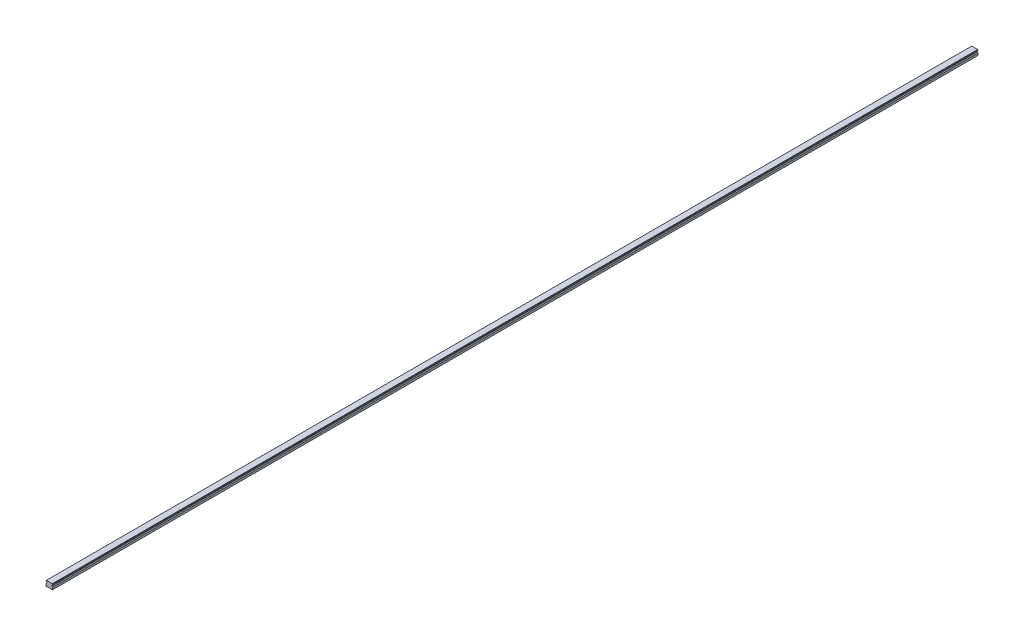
from build123d import *

# Parameters (mm, degrees)
SKETCH1_W           = 20
SKETCH1_H           = 16.3
BOSS_EXTRUDE1_DEPTH = 1400
CUT_EXTRUDE1_DEPTH  = 2801.065301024
CHAMFER1_SIZE       = 1
FILLET1_R           = 1
CUT_EXTRUDE2_DEPTH  = 2801.065301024
SKETCH5_R           = 3
SKETCH5_R_2         = 2.5
CUT_EXTRUDE5_DEPTH  = 10
SKETCH5_2_R         = 2.5
CUT_EXTRUDE6_DEPTH  = 13
LPATTERN2_COUNT     = 47
LPATTERN2_PITCH     = 60


with BuildPart() as part:
    # Sketch1 → Boss-Extrude1 (new, symmetric)
    with BuildSketch(Plane.XY):
        with Locations((0, 8.15)):
            Rectangle(SKETCH1_W, SKETCH1_H)
    extrude(amount=BOSS_EXTRUDE1_DEPTH, both=True)

    # Sketch2 → Cut-Extrude1 (cut, through all)
    with BuildSketch(Plane.XY.offset(1400)):
        Polygon((-10, 14.3), (-10, 7.3), (-7.666666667, 9.633333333), (-7.666666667, 11.966666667), align=None)
        Polygon((7.666666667, 11.966666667), (10, 14.3), (10, 7.3), (7.666666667, 9.633333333), align=None)
    extrude(amount=-CUT_EXTRUDE1_DEPTH, mode=Mode.SUBTRACT)

    # Chamfer1
    chamfer1_edges = [part.edges().sort_by_distance(p)[0] for p in [
        (-10, 16.3, 0),
        (10, 16.3, 0),
        (10, 0, 0),
        (-10, 0, 0),
    ]]
    chamfer(chamfer1_edges, length=CHAMFER1_SIZE)

    # Fillet1
    fillet1_edges = [part.edges().sort_by_distance(p)[0] for p in [
        (-7.666666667, 11.966666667, 0),
        (-7.666666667, 9.633333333, 0),
        (7.666666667, 9.633333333, 0),
        (7.666666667, 11.966666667, 0),
    ]]
    fillet(fillet1_edges, radius=FILLET1_R)

    # Sketch3 → Cut-Extrude2 (cut, through all)
    with BuildSketch(Plane.XY.offset(1400)):
        Polygon((-6, 0), (-5, 1), (5, 1), (6, 0), align=None)
    extrude(amount=-CUT_EXTRUDE2_DEPTH, mode=Mode.SUBTRACT)

    # Sketch5 → Cut-Extrude5 (cut)
    with BuildSketch(Plane.XZ.offset(-1)):
        with Locations(Location((0, 1380, 0), (0, 0, 270))):
            Circle(SKETCH5_R)
        with Locations(Location((0, 1380, 0), (0, 0, 270))):
            Circle(SKETCH5_R_2, mode=Mode.SUBTRACT)
    cut_extrude5 = extrude(amount=-CUT_EXTRUDE5_DEPTH, mode=Mode.SUBTRACT)

    # Sketch5_2 → Cut-Extrude6 (cut)
    with BuildSketch(Plane.XZ.offset(-1)):
        with Locations(Location((0, 1380, 0), (0, 0, 270))):
            Circle(SKETCH5_2_R)
    cut_extrude6 = extrude(amount=-CUT_EXTRUDE6_DEPTH, mode=Mode.SUBTRACT)

    # Cut-Extrude7 cone 1 section (on through the dimple's axis) → Cut-Extrude7 (revolve, cut)
    with BuildSketch(Plane(origin=(0, 14, 1380), x_dir=(0, 0, -1), z_dir=(1, 0, 0))):
        Polygon((0, 0), (2.5, 0), (0, 1.443375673), align=None)
    cut_extrude7 = revolve(axis=Axis((0, 14, 1380), (0, 1, 0)), mode=Mode.SUBTRACT)

    # LPattern2: Cut-Extrude5, Cut-Extrude6, Cut-Extrude7 ×47
    with Locations(*[(0, 0, -i * LPATTERN2_PITCH) for i in range(1, LPATTERN2_COUNT)]):
        add(cut_extrude5, mode=Mode.SUBTRACT)
        add(cut_extrude6, mode=Mode.SUBTRACT)
        add(cut_extrude7, mode=Mode.SUBTRACT)


solid = part.part
